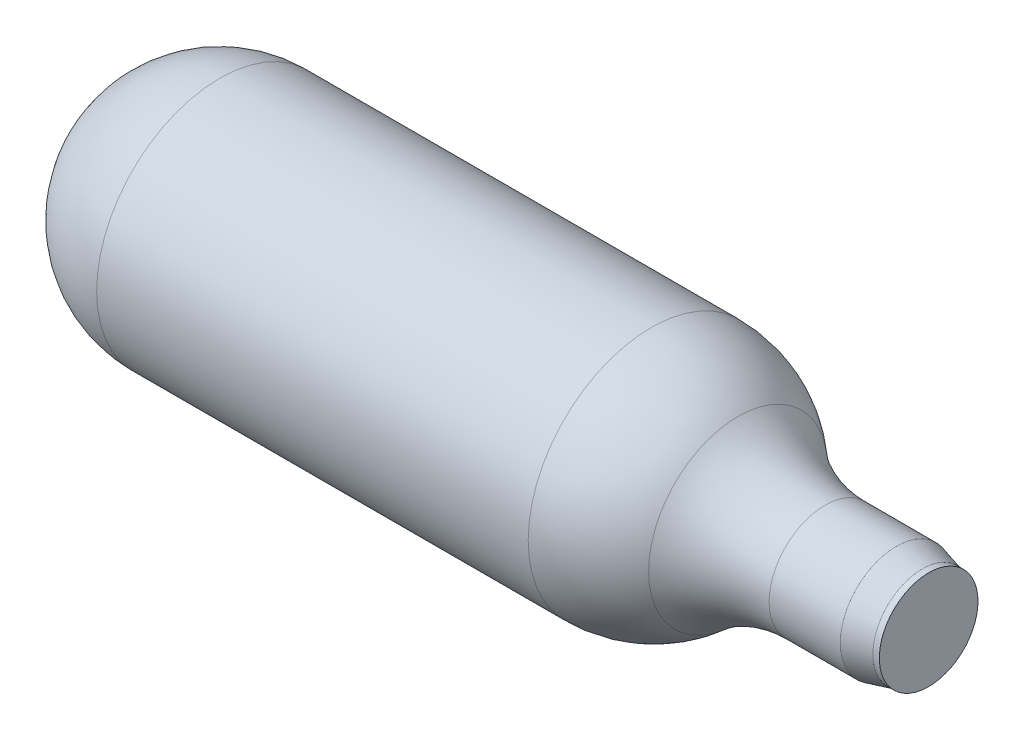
ISO-10303-21;
HEADER;
FILE_DESCRIPTION(('STEP AP214'),'2;1');
FILE_NAME('part.step','',(''),(''),'','','');
FILE_SCHEMA(('AUTOMOTIVE_DESIGN { 1 0 10303 214 1 1 1 1 }'));
ENDSEC;
DATA;
#1=APPLICATION_CONTEXT('core data for automotive mechanical design processes');
#2=APPLICATION_PROTOCOL_DEFINITION('international standard','automotive_design',2000,#1);
#3=PRODUCT_CONTEXT('',#1,'mechanical');
#4=PRODUCT('Part','Part','',(#3));
#5=PRODUCT_RELATED_PRODUCT_CATEGORY('part','',(#4));
#6=PRODUCT_DEFINITION_FORMATION('','',#4);
#7=PRODUCT_DEFINITION_CONTEXT('part definition',#1,'design');
#8=PRODUCT_DEFINITION('design','',#6,#7);
#9=PRODUCT_DEFINITION_SHAPE('','',#8);
#10=(LENGTH_UNIT() NAMED_UNIT(*) SI_UNIT(.MILLI.,.METRE.));
#11=(NAMED_UNIT(*) PLANE_ANGLE_UNIT() SI_UNIT($,.RADIAN.));
#12=(NAMED_UNIT(*) SI_UNIT($,.STERADIAN.) SOLID_ANGLE_UNIT());
#13=UNCERTAINTY_MEASURE_WITH_UNIT(LENGTH_MEASURE(1.E-05),#10,'distance_accuracy_value','');
#14=(GEOMETRIC_REPRESENTATION_CONTEXT(3) GLOBAL_UNCERTAINTY_ASSIGNED_CONTEXT((#13)) GLOBAL_UNIT_ASSIGNED_CONTEXT((#10,
#11,#12)) REPRESENTATION_CONTEXT('',''));
#15=CARTESIAN_POINT('',(0.,0.,0.));
#16=DIRECTION('',(0.,0.,1.));
#17=DIRECTION('',(1.,0.,0.));
#18=AXIS2_PLACEMENT_3D('',#15,#16,#17);
#19=CARTESIAN_POINT('',(71.9038755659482,0.,0.));
#20=DIRECTION('',(-1.,0.,0.));
#21=DIRECTION('',(0.,0.,1.));
#22=AXIS2_PLACEMENT_3D('',#19,#20,#21);
#23=CYLINDRICAL_SURFACE('',#22,4.325);
#24=CARTESIAN_POINT('',(61.75,0.,0.));
#25=DIRECTION('',(1.,0.,0.));
#26=DIRECTION('',(0.,0.,-1.));
#27=AXIS2_PLACEMENT_3D('',#24,#25,#26);
#28=CIRCLE('',#27,4.325);
#29=CARTESIAN_POINT('',(61.75,0.,-4.325));
#30=VERTEX_POINT('',#29);
#31=EDGE_CURVE('E11',#30,#30,#28,.F.);
#32=ORIENTED_EDGE('',*,*,#31,.T.);
#33=EDGE_LOOP('',(#32));
#34=FACE_BOUND('',#33,.T.);
#35=CARTESIAN_POINT('',(56.25,0.,0.));
#36=DIRECTION('',(-1.,0.,0.));
#37=DIRECTION('',(0.,0.,1.));
#38=AXIS2_PLACEMENT_3D('',#35,#36,#37);
#39=CIRCLE('',#38,4.325);
#40=CARTESIAN_POINT('',(56.25,0.,4.325));
#41=VERTEX_POINT('',#40);
#42=EDGE_CURVE('E55',#41,#41,#39,.T.);
#43=ORIENTED_EDGE('',*,*,#42,.F.);
#44=EDGE_LOOP('',(#43));
#45=FACE_BOUND('',#44,.T.);
#46=ADVANCED_FACE('F35',(#34,#45),#23,.T.);
#47=CARTESIAN_POINT('',(9.5,0.,0.));
#48=DIRECTION('',(-1.,0.,0.));
#49=DIRECTION('',(0.,1.,0.));
#50=AXIS2_PLACEMENT_3D('',#47,#48,#49);
#51=SPHERICAL_SURFACE('',#50,9.5);
#52=CARTESIAN_POINT('',(9.5,0.,0.));
#53=DIRECTION('',(-1.,0.,0.));
#54=DIRECTION('',(0.,0.,1.));
#55=AXIS2_PLACEMENT_3D('',#52,#53,#54);
#56=CIRCLE('',#55,9.5);
#57=CARTESIAN_POINT('',(9.5,0.,9.5));
#58=VERTEX_POINT('',#57);
#59=EDGE_CURVE('E42',#58,#58,#56,.T.);
#60=ORIENTED_EDGE('',*,*,#59,.T.);
#61=EDGE_LOOP('',(#60));
#62=FACE_BOUND('',#61,.T.);
#63=ADVANCED_FACE('F77',(#62),#51,.T.);
#64=CARTESIAN_POINT('',(71.9038755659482,0.,0.));
#65=DIRECTION('',(-1.,0.,0.));
#66=DIRECTION('',(0.,0.,1.));
#67=AXIS2_PLACEMENT_3D('',#64,#65,#66);
#68=CYLINDRICAL_SURFACE('',#67,9.5);
#69=ORIENTED_EDGE('',*,*,#59,.F.);
#70=EDGE_LOOP('',(#69));
#71=FACE_BOUND('',#70,.T.);
#72=CARTESIAN_POINT('',(42.825419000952,0.,0.));
#73=DIRECTION('',(-1.,0.,0.));
#74=DIRECTION('',(0.,0.,1.));
#75=AXIS2_PLACEMENT_3D('',#72,#73,#74);
#76=CIRCLE('',#75,9.5);
#77=CARTESIAN_POINT('',(42.825419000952,0.,9.5));
#78=VERTEX_POINT('',#77);
#79=EDGE_CURVE('E46',#78,#78,#76,.T.);
#80=ORIENTED_EDGE('',*,*,#79,.T.);
#81=EDGE_LOOP('',(#80));
#82=FACE_BOUND('',#81,.T.);
#83=ADVANCED_FACE('F82',(#71,#82),#68,.T.);
#84=CARTESIAN_POINT('',(42.825419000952,0.,0.));
#85=DIRECTION('',(-1.,0.,0.));
#86=DIRECTION('',(0.,0.,1.));
#87=AXIS2_PLACEMENT_3D('',#84,#85,#86);
#88=DEGENERATE_TOROIDAL_SURFACE('',#87,0.499999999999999,10.,.F.);
#89=ORIENTED_EDGE('',*,*,#79,.F.);
#90=EDGE_LOOP('',(#89));
#91=FACE_BOUND('',#90,.T.);
#92=CARTESIAN_POINT('',(49.537709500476,0.,0.));
#93=DIRECTION('',(-1.,0.,0.));
#94=DIRECTION('',(0.,0.,1.));
#95=AXIS2_PLACEMENT_3D('',#92,#93,#94);
#96=CIRCLE('',#95,6.9125);
#97=CARTESIAN_POINT('',(49.537709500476,0.,6.9125));
#98=VERTEX_POINT('',#97);
#99=EDGE_CURVE('E50',#98,#98,#96,.T.);
#100=ORIENTED_EDGE('',*,*,#99,.T.);
#101=EDGE_LOOP('',(#100));
#102=FACE_BOUND('',#101,.T.);
#103=ADVANCED_FACE('F89',(#91,#102),#88,.F.);
#104=CARTESIAN_POINT('',(56.25,0.,0.));
#105=DIRECTION('',(-1.,0.,0.));
#106=DIRECTION('',(0.,0.,1.));
#107=AXIS2_PLACEMENT_3D('',#104,#105,#106);
#108=TOROIDAL_SURFACE('',#107,14.325,10.);
#109=ORIENTED_EDGE('',*,*,#99,.F.);
#110=EDGE_LOOP('',(#109));
#111=FACE_BOUND('',#110,.T.);
#112=ORIENTED_EDGE('',*,*,#42,.T.);
#113=EDGE_LOOP('',(#112));
#114=FACE_BOUND('',#113,.T.);
#115=ADVANCED_FACE('F86',(#111,#114),#108,.F.);
#116=CARTESIAN_POINT('',(63.75,0.,0.));
#117=DIRECTION('',(1.,0.,0.));
#118=DIRECTION('',(0.,0.,-1.));
#119=AXIS2_PLACEMENT_3D('',#116,#117,#118);
#120=CYLINDRICAL_SURFACE('',#119,3.81);
#121=CARTESIAN_POINT('',(63.75,0.,0.));
#122=DIRECTION('',(1.,0.,0.));
#123=DIRECTION('',(0.,0.,-1.));
#124=AXIS2_PLACEMENT_3D('',#121,#122,#123);
#125=CIRCLE('',#124,3.81);
#126=CARTESIAN_POINT('',(63.75,0.,-3.81));
#127=VERTEX_POINT('',#126);
#128=EDGE_CURVE('E58',#127,#127,#125,.T.);
#129=ORIENTED_EDGE('',*,*,#128,.T.);
#130=EDGE_LOOP('',(#129));
#131=FACE_BOUND('',#130,.T.);
#132=CARTESIAN_POINT('',(64.25,0.,0.));
#133=DIRECTION('',(1.,0.,0.));
#134=DIRECTION('',(0.,0.,-1.));
#135=AXIS2_PLACEMENT_3D('',#132,#133,#134);
#136=CIRCLE('',#135,3.81);
#137=CARTESIAN_POINT('',(64.25,0.,-3.81));
#138=VERTEX_POINT('',#137);
#139=EDGE_CURVE('E59',#138,#138,#136,.T.);
#140=ORIENTED_EDGE('',*,*,#139,.F.);
#141=EDGE_LOOP('',(#140));
#142=FACE_BOUND('',#141,.T.);
#143=ADVANCED_FACE('F65',(#131,#142),#120,.T.);
#144=CARTESIAN_POINT('',(64.25,4.325,0.));
#145=DIRECTION('',(-1.,0.,0.));
#146=DIRECTION('',(0.,0.,1.));
#147=AXIS2_PLACEMENT_3D('',#144,#145,#146);
#148=PLANE('',#147);
#149=ORIENTED_EDGE('',*,*,#139,.T.);
#150=EDGE_LOOP('',(#149));
#151=FACE_BOUND('',#150,.T.);
#152=ADVANCED_FACE('F69',(#151),#148,.F.);
#153=CARTESIAN_POINT('',(63.75,0.,0.));
#154=DIRECTION('',(-1.,0.,0.));
#155=DIRECTION('',(0.,0.,1.));
#156=AXIS2_PLACEMENT_3D('',#153,#154,#155);
#157=CONICAL_SURFACE('',#156,3.81,0.252024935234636);
#158=ORIENTED_EDGE('',*,*,#31,.F.);
#159=EDGE_LOOP('',(#158));
#160=FACE_BOUND('',#159,.T.);
#161=ORIENTED_EDGE('',*,*,#128,.F.);
#162=EDGE_LOOP('',(#161));
#163=FACE_BOUND('',#162,.T.);
#164=ADVANCED_FACE('F37',(#160,#163),#157,.T.);
#165=CLOSED_SHELL('',(#46,#63,#83,#103,#115,#143,#152,#164));
#166=MANIFOLD_SOLID_BREP('B2',#165);
#167=ADVANCED_BREP_SHAPE_REPRESENTATION('',(#18,#166),#14);
#168=SHAPE_DEFINITION_REPRESENTATION(#9,#167);
ENDSEC;
END-ISO-10303-21;
